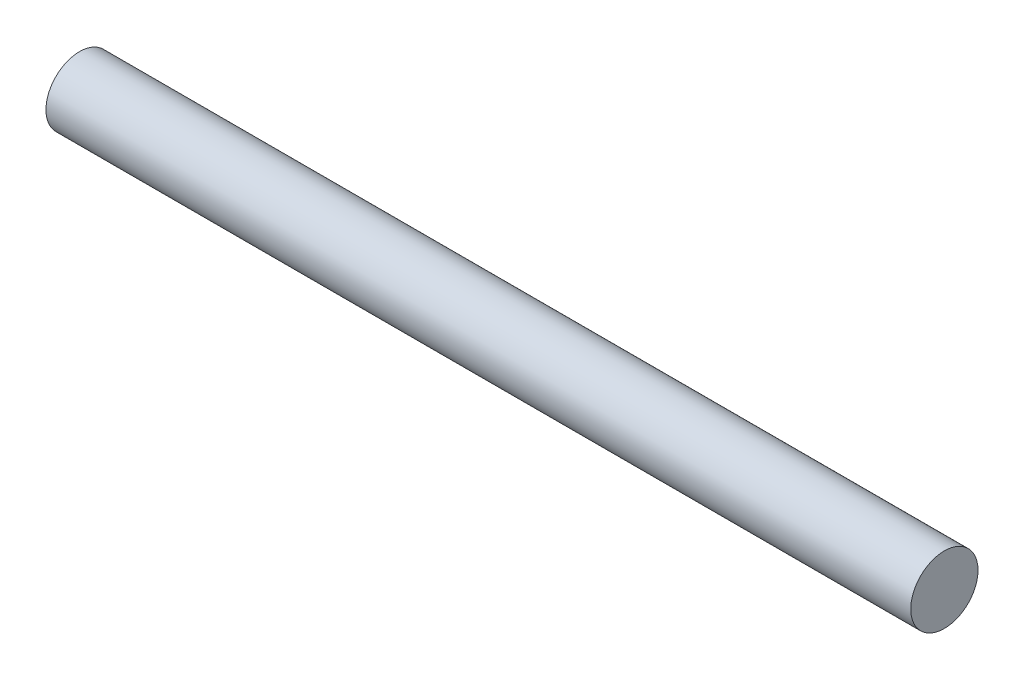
ISO-10303-21;
HEADER;
FILE_DESCRIPTION(('STEP AP214'),'2;1');
FILE_NAME('part.step','',(''),(''),'','','');
FILE_SCHEMA(('AUTOMOTIVE_DESIGN { 1 0 10303 214 1 1 1 1 }'));
ENDSEC;
DATA;
#1=APPLICATION_CONTEXT('core data for automotive mechanical design processes');
#2=APPLICATION_PROTOCOL_DEFINITION('international standard','automotive_design',2000,#1);
#3=PRODUCT_CONTEXT('',#1,'mechanical');
#4=PRODUCT('Part','Part','',(#3));
#5=PRODUCT_RELATED_PRODUCT_CATEGORY('part','',(#4));
#6=PRODUCT_DEFINITION_FORMATION('','',#4);
#7=PRODUCT_DEFINITION_CONTEXT('part definition',#1,'design');
#8=PRODUCT_DEFINITION('design','',#6,#7);
#9=PRODUCT_DEFINITION_SHAPE('','',#8);
#10=(LENGTH_UNIT() NAMED_UNIT(*) SI_UNIT(.MILLI.,.METRE.));
#11=(NAMED_UNIT(*) PLANE_ANGLE_UNIT() SI_UNIT($,.RADIAN.));
#12=(NAMED_UNIT(*) SI_UNIT($,.STERADIAN.) SOLID_ANGLE_UNIT());
#13=UNCERTAINTY_MEASURE_WITH_UNIT(LENGTH_MEASURE(1.E-05),#10,'distance_accuracy_value','');
#14=(GEOMETRIC_REPRESENTATION_CONTEXT(3) GLOBAL_UNCERTAINTY_ASSIGNED_CONTEXT((#13)) GLOBAL_UNIT_ASSIGNED_CONTEXT((#10,
#11,#12)) REPRESENTATION_CONTEXT('',''));
#15=CARTESIAN_POINT('',(0.,0.,0.));
#16=DIRECTION('',(0.,0.,1.));
#17=DIRECTION('',(1.,0.,0.));
#18=AXIS2_PLACEMENT_3D('',#15,#16,#17);
#19=CARTESIAN_POINT('',(36.,0.,0.));
#20=DIRECTION('',(-1.,0.,0.));
#21=DIRECTION('',(0.,0.,1.));
#22=AXIS2_PLACEMENT_3D('',#19,#20,#21);
#23=CYLINDRICAL_SURFACE('',#22,1.4);
#24=CARTESIAN_POINT('',(36.,0.,0.));
#25=DIRECTION('',(1.,0.,0.));
#26=DIRECTION('',(0.,0.,-1.));
#27=AXIS2_PLACEMENT_3D('',#24,#25,#26);
#28=CIRCLE('',#27,1.4);
#29=CARTESIAN_POINT('',(36.,0.,-1.4));
#30=VERTEX_POINT('',#29);
#31=EDGE_CURVE('E10',#30,#30,#28,.T.);
#32=ORIENTED_EDGE('',*,*,#31,.F.);
#33=EDGE_LOOP('',(#32));
#34=FACE_BOUND('',#33,.T.);
#35=CARTESIAN_POINT('',(0.,0.,0.));
#36=DIRECTION('',(1.,0.,0.));
#37=DIRECTION('',(0.,0.,-1.));
#38=AXIS2_PLACEMENT_3D('',#35,#36,#37);
#39=CIRCLE('',#38,1.4);
#40=CARTESIAN_POINT('',(0.,0.,-1.4));
#41=VERTEX_POINT('',#40);
#42=EDGE_CURVE('E38',#41,#41,#39,.T.);
#43=ORIENTED_EDGE('',*,*,#42,.T.);
#44=EDGE_LOOP('',(#43));
#45=FACE_BOUND('',#44,.T.);
#46=ADVANCED_FACE('F35',(#34,#45),#23,.T.);
#47=CARTESIAN_POINT('',(36.,0.,0.));
#48=DIRECTION('',(1.,0.,0.));
#49=DIRECTION('',(0.,0.,-1.));
#50=AXIS2_PLACEMENT_3D('',#47,#48,#49);
#51=PLANE('',#50);
#52=ORIENTED_EDGE('',*,*,#31,.T.);
#53=EDGE_LOOP('',(#52));
#54=FACE_BOUND('',#53,.T.);
#55=ADVANCED_FACE('F50',(#54),#51,.T.);
#56=CARTESIAN_POINT('',(0.,0.,0.));
#57=DIRECTION('',(1.,0.,0.));
#58=DIRECTION('',(0.,0.,-1.));
#59=AXIS2_PLACEMENT_3D('',#56,#57,#58);
#60=PLANE('',#59);
#61=ORIENTED_EDGE('',*,*,#42,.F.);
#62=EDGE_LOOP('',(#61));
#63=FACE_BOUND('',#62,.T.);
#64=ADVANCED_FACE('F48',(#63),#60,.F.);
#65=CLOSED_SHELL('',(#46,#55,#64));
#66=MANIFOLD_SOLID_BREP('B2',#65);
#67=ADVANCED_BREP_SHAPE_REPRESENTATION('',(#18,#66),#14);
#68=SHAPE_DEFINITION_REPRESENTATION(#9,#67);
ENDSEC;
END-ISO-10303-21;
